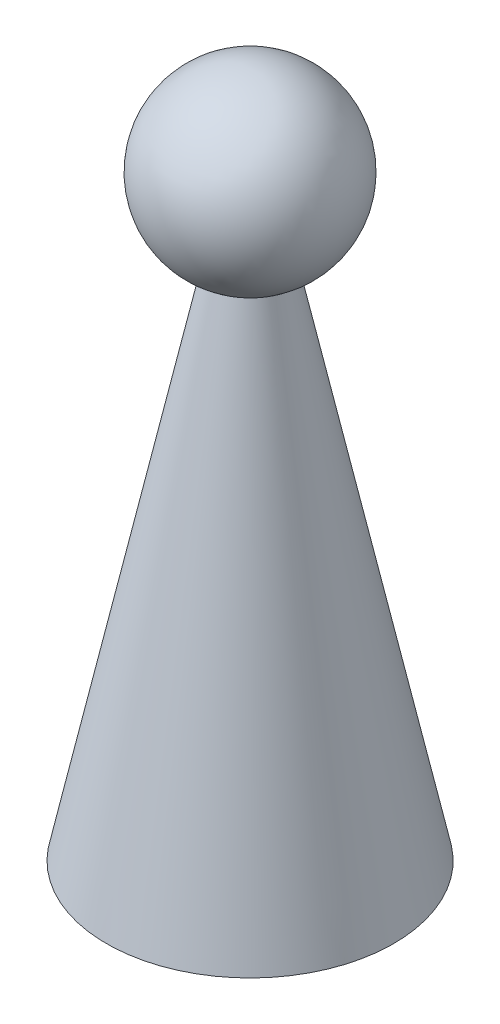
from build123d import *


with BuildPart() as part:
    # GK → Rotation_GK (revolve)
    with BuildSketch(Plane.XY, mode=Mode.PRIVATE) as rotation_gk_sk:
        with BuildLine():
            Line((209.417421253, 0), (0, 0))
            Line((0, 0), (0, 1000))
            ThreePointArc((0, 1000), (127.47548784, 895.495097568), (50, 750))
            Line((50, 750), (209.417421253, 0))
        make_face()
    revolve(rotation_gk_sk.sketch.rotate(Axis((0, 55, 0), (0, -1, 0)), 270), axis=Axis((0, 55, 0), (0, -1, 0)))


solid = part.part
